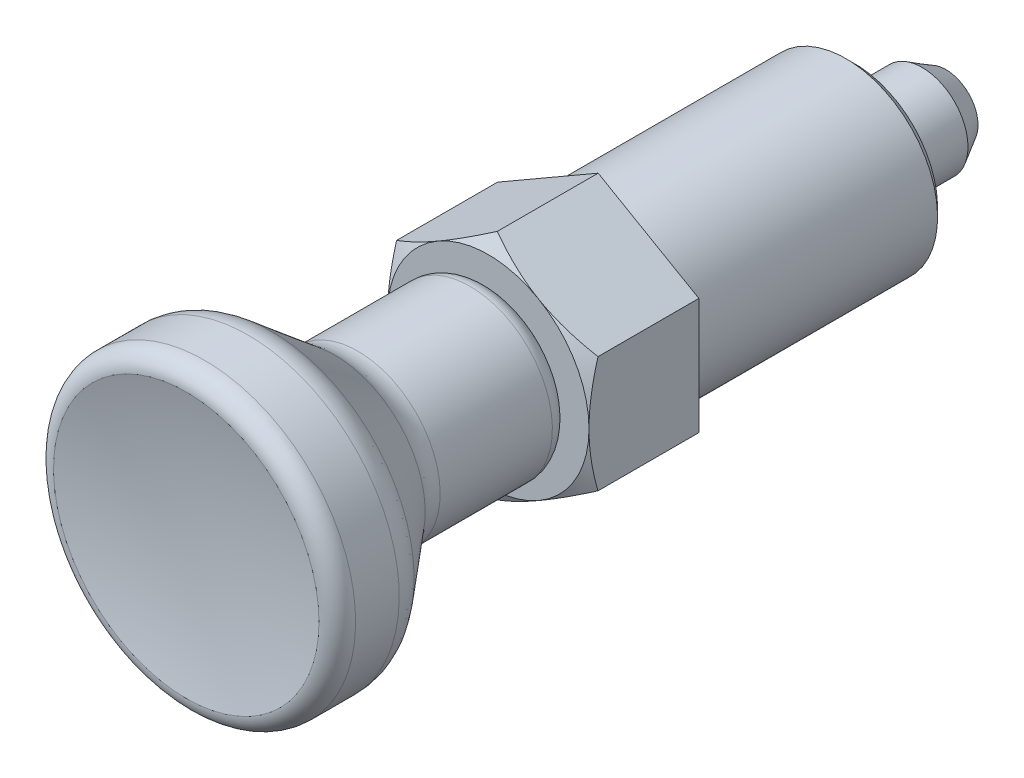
ISO-10303-21;
HEADER;
FILE_DESCRIPTION(('STEP AP214'),'2;1');
FILE_NAME('part.step','',(''),(''),'','','');
FILE_SCHEMA(('AUTOMOTIVE_DESIGN { 1 0 10303 214 1 1 1 1 }'));
ENDSEC;
DATA;
#1=APPLICATION_CONTEXT('core data for automotive mechanical design processes');
#2=APPLICATION_PROTOCOL_DEFINITION('international standard','automotive_design',2000,#1);
#3=PRODUCT_CONTEXT('',#1,'mechanical');
#4=PRODUCT('Part','Part','',(#3));
#5=PRODUCT_RELATED_PRODUCT_CATEGORY('part','',(#4));
#6=PRODUCT_DEFINITION_FORMATION('','',#4);
#7=PRODUCT_DEFINITION_CONTEXT('part definition',#1,'design');
#8=PRODUCT_DEFINITION('design','',#6,#7);
#9=PRODUCT_DEFINITION_SHAPE('','',#8);
#10=(LENGTH_UNIT() NAMED_UNIT(*) SI_UNIT(.MILLI.,.METRE.));
#11=(NAMED_UNIT(*) PLANE_ANGLE_UNIT() SI_UNIT($,.RADIAN.));
#12=(NAMED_UNIT(*) SI_UNIT($,.STERADIAN.) SOLID_ANGLE_UNIT());
#13=UNCERTAINTY_MEASURE_WITH_UNIT(LENGTH_MEASURE(1.E-05),#10,'distance_accuracy_value','');
#14=(GEOMETRIC_REPRESENTATION_CONTEXT(3) GLOBAL_UNCERTAINTY_ASSIGNED_CONTEXT((#13)) GLOBAL_UNIT_ASSIGNED_CONTEXT((#10,
#11,#12)) REPRESENTATION_CONTEXT('',''));
#15=CARTESIAN_POINT('',(0.,0.,0.));
#16=DIRECTION('',(0.,0.,1.));
#17=DIRECTION('',(1.,0.,0.));
#18=AXIS2_PLACEMENT_3D('',#15,#16,#17);
#19=CARTESIAN_POINT('',(0.,0.,10.2679491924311));
#20=DIRECTION('',(0.,0.,-1.));
#21=DIRECTION('',(0.,1.,0.));
#22=AXIS2_PLACEMENT_3D('',#19,#20,#21);
#23=CONICAL_SURFACE('',#22,14.,1.0471975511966);
#24=CARTESIAN_POINT('',(-11.,16.9475873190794,6.68579522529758));
#25=CARTESIAN_POINT('',(-11.,16.7078395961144,6.80189876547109));
#26=CARTESIAN_POINT('',(-11.,16.4678075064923,6.9174148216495));
#27=CARTESIAN_POINT('',(-11.,15.9871152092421,7.14713868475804));
#28=CARTESIAN_POINT('',(-11.,15.7464549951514,7.26134647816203));
#29=CARTESIAN_POINT('',(-11.,15.0233774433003,7.60183836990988));
#30=CARTESIAN_POINT('',(-11.,14.5399358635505,7.82595569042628));
#31=CARTESIAN_POINT('',(-11.,13.5670950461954,8.2682662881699));
#32=CARTESIAN_POINT('',(-11.,13.0776776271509,8.48641967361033));
#33=CARTESIAN_POINT('',(-11.,12.0949113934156,8.91365213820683));
#34=CARTESIAN_POINT('',(-11.,11.601562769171,9.12273165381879));
#35=CARTESIAN_POINT('',(-11.,10.5946510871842,9.53576885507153));
#36=CARTESIAN_POINT('',(-11.,10.0809379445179,9.73936259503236));
#37=CARTESIAN_POINT('',(-11.,9.04745673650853,10.130870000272));
#38=CARTESIAN_POINT('',(-11.,8.52768799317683,10.3187818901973));
#39=CARTESIAN_POINT('',(-11.,7.48229548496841,10.6739078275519));
#40=CARTESIAN_POINT('',(-11.,6.95668640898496,10.8411647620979));
#41=CARTESIAN_POINT('',(-11.,5.89787966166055,11.1495490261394));
#42=CARTESIAN_POINT('',(-11.,5.36468447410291,11.2906847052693));
#43=CARTESIAN_POINT('',(-11.,4.56058944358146,11.4772509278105));
#44=CARTESIAN_POINT('',(-11.,4.29255941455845,11.5351292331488));
#45=CARTESIAN_POINT('',(-11.,3.75468924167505,11.6418066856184));
#46=CARTESIAN_POINT('',(-11.,3.48484913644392,11.6906060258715));
#47=CARTESIAN_POINT('',(-11.,2.94355241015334,11.7782575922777));
#48=CARTESIAN_POINT('',(-11.,2.6720958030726,11.8171099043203));
#49=CARTESIAN_POINT('',(-11.,2.12786354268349,11.8840882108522));
#50=CARTESIAN_POINT('',(-11.,1.85508793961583,11.9122146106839));
#51=CARTESIAN_POINT('',(-11.,1.31211051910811,11.9568359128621));
#52=CARTESIAN_POINT('',(-11.,1.04192067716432,11.9734756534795));
#53=CARTESIAN_POINT('',(-11.,0.501080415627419,11.9953220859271));
#54=CARTESIAN_POINT('',(-11.,0.230430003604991,12.0005289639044));
#55=CARTESIAN_POINT('',(-11.,-0.310849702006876,11.9993861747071));
#56=CARTESIAN_POINT('',(-11.,-0.581478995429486,11.9930364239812));
#57=CARTESIAN_POINT('',(-11.,-1.12223262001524,11.9689333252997));
#58=CARTESIAN_POINT('',(-11.,-1.39235692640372,11.9511794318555));
#59=CARTESIAN_POINT('',(-11.,-2.04498166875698,11.8948814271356));
#60=CARTESIAN_POINT('',(-11.,-2.42700715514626,11.8507360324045));
#61=CARTESIAN_POINT('',(-11.,-3.18815089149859,11.7420670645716));
#62=CARTESIAN_POINT('',(-11.,-3.56726872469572,11.6775406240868));
#63=CARTESIAN_POINT('',(-11.,-4.32226099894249,11.5304052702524));
#64=CARTESIAN_POINT('',(-11.,-4.69813259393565,11.4477818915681));
#65=CARTESIAN_POINT('',(-11.,-5.44607034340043,11.2669675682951));
#66=CARTESIAN_POINT('',(-11.,-5.81813656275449,11.1687768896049));
#67=CARTESIAN_POINT('',(-11.,-6.56654933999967,10.9569168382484));
#68=CARTESIAN_POINT('',(-11.,-6.94281324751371,10.8429575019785));
#69=CARTESIAN_POINT('',(-11.,-7.69163354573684,10.6035085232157));
#70=CARTESIAN_POINT('',(-11.,-8.0641899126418,10.4780188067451));
#71=CARTESIAN_POINT('',(-11.,-8.80578324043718,10.2174800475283));
#72=CARTESIAN_POINT('',(-11.,-9.17482138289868,10.0824343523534));
#73=CARTESIAN_POINT('',(-11.,-9.90985646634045,9.80434835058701));
#74=CARTESIAN_POINT('',(-11.,-10.2758534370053,9.6613081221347));
#75=CARTESIAN_POINT('',(-11.,-11.1142135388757,9.3247854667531));
#76=CARTESIAN_POINT('',(-11.,-11.5856547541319,9.12901029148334));
#77=CARTESIAN_POINT('',(-11.,-12.5247285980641,8.7285047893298));
#78=CARTESIAN_POINT('',(-11.,-12.9923610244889,8.52377399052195));
#79=CARTESIAN_POINT('',(-11.,-13.9244936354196,8.10708188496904));
#80=CARTESIAN_POINT('',(-11.,-14.3889931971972,7.89511918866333));
#81=CARTESIAN_POINT('',(-11.,-15.3152712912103,7.46536426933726));
#82=CARTESIAN_POINT('',(-11.,-15.7770498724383,7.24757215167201));
#83=CARTESIAN_POINT('',(-11.,-16.6987730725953,6.80699211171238));
#84=CARTESIAN_POINT('',(-11.,-17.1587154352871,6.58419947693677));
#85=CARTESIAN_POINT('',(-11.,-18.0766600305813,6.13465365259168));
#86=CARTESIAN_POINT('',(-11.,-18.5346622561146,5.90790044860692));
#87=CARTESIAN_POINT('',(-11.,-19.4489632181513,5.45111550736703));
#88=CARTESIAN_POINT('',(-11.,-19.9052621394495,5.22108413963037));
#89=CARTESIAN_POINT('',(-11.,-20.8164463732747,4.75823700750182));
#90=CARTESIAN_POINT('',(-11.,-21.2713316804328,4.52542123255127));
#91=CARTESIAN_POINT('',(-11.,-22.562113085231,3.86056086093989));
#92=CARTESIAN_POINT('',(-11.,-23.3965608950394,3.42570443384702));
#93=CARTESIAN_POINT('',(-11.,-25.0623255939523,2.54998818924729));
#94=CARTESIAN_POINT('',(-11.,-25.893642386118,2.10912818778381));
#95=CARTESIAN_POINT('',(-11.,-27.5519148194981,1.22379199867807));
#96=CARTESIAN_POINT('',(-11.,-28.3788760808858,0.77932633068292));
#97=CARTESIAN_POINT('',(-11.,-29.6178277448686,0.109922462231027));
#98=CARTESIAN_POINT('',(-11.,-30.0305531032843,-0.113657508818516));
#99=CARTESIAN_POINT('',(-11.,-30.8555616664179,-0.561630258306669));
#100=CARTESIAN_POINT('',(-11.,-31.2678448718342,-0.786023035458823));
#101=CARTESIAN_POINT('',(-11.,-31.6799315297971,-1.0107762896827));
#102=B_SPLINE_CURVE_WITH_KNOTS('',3,(#24,#25,#26,#27,#28,#29,#30,#31,#32,#33,#34,#35,#36,#37,
#38,#39,#40,#41,#42,#43,#44,#45,#46,#47,#48,#49,#50,#51,#52,#53,#54,#55,#56,#57,#58,#59,#60,#61,
#62,#63,#64,#65,#66,#67,#68,#69,#70,#71,#72,#73,#74,#75,#76,#77,#78,#79,#80,#81,#82,#83,#84,#85,
#86,#87,#88,#89,#90,#91,#92,#93,#94,#95,#96,#97,#98,#99,#100,#101),.UNSPECIFIED.,.F.,.F.,(4,2,2,
2,2,2,2,2,2,2,2,2,2,2,2,2,2,2,2,2,2,2,2,2,2,2,2,2,2,2,2,2,2,2,2,2,2,2,4),(0.,0.799142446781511,
1.5982931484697,3.19683688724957,4.80427343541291,6.41163257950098,8.0691960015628,
9.72694682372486,11.3811955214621,13.0349145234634,13.8574094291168,14.6798868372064,
15.5023571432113,16.3247963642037,17.1366658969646,17.9485222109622,18.7603843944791,
19.5722854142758,20.7253478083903,21.8785724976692,23.0327223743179,24.1868525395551,
25.3660595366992,26.5452741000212,27.7240775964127,28.902869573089,30.434171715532,
31.9655546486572,33.4972335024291,35.0288846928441,36.5620455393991,38.0952119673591,
39.6282069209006,41.1612076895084,43.9840470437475,46.8069730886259,49.6234714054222,
51.0316511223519,52.439828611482),.UNSPECIFIED.);
#103=CARTESIAN_POINT('',(-11.,-6.3508529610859,11.0175196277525));
#104=VERTEX_POINT('',#103);
#105=CARTESIAN_POINT('',(-11.,0.,12.));
#106=VERTEX_POINT('',#105);
#107=EDGE_CURVE('E9',#104,#106,#102,.F.);
#108=ORIENTED_EDGE('',*,*,#107,.F.);
#109=CARTESIAN_POINT('',(0.000200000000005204,-12.7018213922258,11.0174529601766));
#110=CARTESIAN_POINT('',(-0.241603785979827,-12.5622159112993,11.0980408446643));
#111=CARTESIAN_POINT('',(-0.484309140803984,-12.4220899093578,11.1749710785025));
#112=CARTESIAN_POINT('',(-0.971666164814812,-12.1407142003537,11.3205013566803));
#113=CARTESIAN_POINT('',(-1.21631844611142,-11.9994641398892,11.3890986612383));
#114=CARTESIAN_POINT('',(-1.95421736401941,-11.5734380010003,11.5810636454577));
#115=CARTESIAN_POINT('',(-2.45037695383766,-11.2869801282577,11.6902522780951));
#116=CARTESIAN_POINT('',(-3.19285703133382,-10.8583090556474,11.8182858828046));
#117=CARTESIAN_POINT('',(-3.43695934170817,-10.7173765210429,11.8547577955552));
#118=CARTESIAN_POINT('',(-3.9262941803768,-10.4348589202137,11.9159186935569));
#119=CARTESIAN_POINT('',(-4.17152673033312,-10.2932738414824,11.9406074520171));
#120=CARTESIAN_POINT('',(-4.66240068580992,-10.0098676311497,11.9775696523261));
#121=CARTESIAN_POINT('',(-4.90804125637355,-9.86804698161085,11.9898578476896));
#122=CARTESIAN_POINT('',(-5.3995500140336,-9.58427426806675,12.0017570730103));
#123=CARTESIAN_POINT('',(-5.64541819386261,-9.4423222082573,12.0013684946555));
#124=CARTESIAN_POINT('',(-6.10507018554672,-9.17694200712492,11.9887988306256));
#125=CARTESIAN_POINT('',(-6.31888677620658,-9.05349494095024,11.9781509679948));
#126=CARTESIAN_POINT('',(-6.7460281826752,-8.80688473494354,11.9474683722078));
#127=CARTESIAN_POINT('',(-6.95935296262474,-8.68372161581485,11.9274329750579));
#128=CARTESIAN_POINT('',(-7.38539481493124,-8.43774623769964,11.8783246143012));
#129=CARTESIAN_POINT('',(-7.59811123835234,-8.31493435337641,11.8492441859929));
#130=CARTESIAN_POINT('',(-8.02254681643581,-8.06988635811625,11.7825560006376));
#131=CARTESIAN_POINT('',(-8.23426590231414,-7.94765028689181,11.7449476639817));
#132=CARTESIAN_POINT('',(-8.87695113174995,-7.57659579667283,11.6183800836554));
#133=CARTESIAN_POINT('',(-9.30605612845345,-7.32885191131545,11.5168005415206));
#134=CARTESIAN_POINT('',(-10.1578675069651,-6.83705838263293,11.286256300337));
#135=CARTESIAN_POINT('',(-10.580584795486,-6.59300244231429,11.1573457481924));
#136=CARTESIAN_POINT('',(-11.0002,-6.35073749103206,11.0174529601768));
#137=B_SPLINE_CURVE_WITH_KNOTS('',3,(#109,#110,#111,#112,#113,#114,#115,#116,#117,#118,#119,
#120,#121,#122,#123,#124,#125,#126,#127,#128,#129,#130,#131,#132,#133,#134,#135,#136),
.UNSPECIFIED.,.F.,.F.,(4,2,2,2,2,2,2,2,2,2,2,2,2,4),(0.,0.871755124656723,1.74379610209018,
3.49159027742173,4.34403665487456,5.19649943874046,6.04794680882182,6.89936787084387,
7.64056020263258,8.38180496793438,9.12366309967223,9.86557166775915,11.3820155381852,
12.8954827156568),.UNSPECIFIED.);
#138=CARTESIAN_POINT('',(-5.50000000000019,-9.52627944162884,12.));
#139=VERTEX_POINT('',#138);
#140=EDGE_CURVE('E204',#139,#104,#137,.T.);
#141=ORIENTED_EDGE('',*,*,#140,.F.);
#142=CARTESIAN_POINT('',(0.,0.,12.));
#143=DIRECTION('',(0.,0.,1.));
#144=DIRECTION('',(0.,-1.,0.));
#145=AXIS2_PLACEMENT_3D('',#142,#143,#144);
#146=CIRCLE('',#145,11.);
#147=EDGE_CURVE('E262',#106,#139,#146,.T.);
#148=ORIENTED_EDGE('',*,*,#147,.F.);
#149=EDGE_LOOP('',(#108,#141,#148));
#150=FACE_BOUND('',#149,.T.);
#151=ADVANCED_FACE('F14',(#150),#23,.T.);
#152=CARTESIAN_POINT('',(-11.,6.3508529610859,11.0175196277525));
#153=VERTEX_POINT('',#152);
#154=EDGE_CURVE('E18',#106,#153,#102,.F.);
#155=ORIENTED_EDGE('',*,*,#154,.F.);
#156=CARTESIAN_POINT('',(-5.50000000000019,9.52627944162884,12.));
#157=VERTEX_POINT('',#156);
#158=EDGE_CURVE('E116',#157,#106,#146,.T.);
#159=ORIENTED_EDGE('',*,*,#158,.F.);
#160=CARTESIAN_POINT('',(-11.0002,6.35073749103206,11.0174529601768));
#161=CARTESIAN_POINT('',(-10.7583962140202,6.49034297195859,11.0980408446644));
#162=CARTESIAN_POINT('',(-10.515690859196,6.63046897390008,11.1749710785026));
#163=CARTESIAN_POINT('',(-10.0283338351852,6.91184468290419,11.3205013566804));
#164=CARTESIAN_POINT('',(-9.78368155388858,7.05309474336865,11.3890986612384));
#165=CARTESIAN_POINT('',(-9.04578263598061,7.47912088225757,11.5810636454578));
#166=CARTESIAN_POINT('',(-8.54962304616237,7.76557875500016,11.6902522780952));
#167=CARTESIAN_POINT('',(-7.80714296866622,8.19424982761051,11.8182858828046));
#168=CARTESIAN_POINT('',(-7.56304065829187,8.33518236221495,11.8547577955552));
#169=CARTESIAN_POINT('',(-7.07370581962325,8.61769996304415,11.9159186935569));
#170=CARTESIAN_POINT('',(-6.82847326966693,8.7592850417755,11.9406074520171));
#171=CARTESIAN_POINT('',(-6.33759931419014,9.04269125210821,11.9775696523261));
#172=CARTESIAN_POINT('',(-6.09195874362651,9.18451190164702,11.9898578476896));
#173=CARTESIAN_POINT('',(-5.60044998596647,9.46828461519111,12.0017570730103));
#174=CARTESIAN_POINT('',(-5.35458180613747,9.61023667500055,12.0013684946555));
#175=CARTESIAN_POINT('',(-4.89492981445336,9.87561687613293,11.9887988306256));
#176=CARTESIAN_POINT('',(-4.6811132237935,9.99906394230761,11.9781509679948));
#177=CARTESIAN_POINT('',(-4.25397181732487,10.2456741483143,11.9474683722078));
#178=CARTESIAN_POINT('',(-4.04064703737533,10.368837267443,11.9274329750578));
#179=CARTESIAN_POINT('',(-3.61460518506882,10.6148126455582,11.8783246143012));
#180=CARTESIAN_POINT('',(-3.40188876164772,10.7376245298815,11.8492441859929));
#181=CARTESIAN_POINT('',(-2.97745318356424,10.9826725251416,11.7825560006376));
#182=CARTESIAN_POINT('',(-2.76573409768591,11.1049085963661,11.7449476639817));
#183=CARTESIAN_POINT('',(-2.12304886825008,11.475963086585,11.6183800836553));
#184=CARTESIAN_POINT('',(-1.69394387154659,11.7237069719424,11.5168005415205));
#185=CARTESIAN_POINT('',(-0.842132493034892,12.215500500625,11.2862563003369));
#186=CARTESIAN_POINT('',(-0.41941520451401,12.4595564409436,11.1573457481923));
#187=CARTESIAN_POINT('',(0.000199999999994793,12.7018213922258,11.0174529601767));
#188=B_SPLINE_CURVE_WITH_KNOTS('',3,(#160,#161,#162,#163,#164,#165,#166,#167,#168,#169,#170,
#171,#172,#173,#174,#175,#176,#177,#178,#179,#180,#181,#182,#183,#184,#185,#186,#187),
.UNSPECIFIED.,.F.,.F.,(4,2,2,2,2,2,2,2,2,2,2,2,2,4),(0.,0.871755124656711,1.74379610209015,
3.49159027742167,4.34403665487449,5.19649943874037,6.04794680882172,6.89936787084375,
7.64056020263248,8.38180496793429,9.12366309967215,9.86557166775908,11.3820155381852,
12.8954827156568),.UNSPECIFIED.);
#189=EDGE_CURVE('E265',#153,#157,#188,.T.);
#190=ORIENTED_EDGE('',*,*,#189,.F.);
#191=EDGE_LOOP('',(#155,#159,#190));
#192=FACE_BOUND('',#191,.T.);
#193=ADVANCED_FACE('F226',(#192),#23,.T.);
#194=CARTESIAN_POINT('',(0.,12.701705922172,11.0175196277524));
#195=VERTEX_POINT('',#194);
#196=EDGE_CURVE('E112',#157,#195,#188,.T.);
#197=ORIENTED_EDGE('',*,*,#196,.F.);
#198=CARTESIAN_POINT('',(5.50000000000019,9.52627944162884,12.));
#199=VERTEX_POINT('',#198);
#200=EDGE_CURVE('E110',#199,#157,#146,.T.);
#201=ORIENTED_EDGE('',*,*,#200,.F.);
#202=CARTESIAN_POINT('',(-0.000200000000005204,12.7018213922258,11.0174529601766));
#203=CARTESIAN_POINT('',(0.241603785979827,12.5622159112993,11.0980408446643));
#204=CARTESIAN_POINT('',(0.484309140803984,12.4220899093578,11.1749710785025));
#205=CARTESIAN_POINT('',(0.971666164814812,12.1407142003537,11.3205013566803));
#206=CARTESIAN_POINT('',(1.21631844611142,11.9994641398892,11.3890986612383));
#207=CARTESIAN_POINT('',(1.95421736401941,11.5734380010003,11.5810636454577));
#208=CARTESIAN_POINT('',(2.45037695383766,11.2869801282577,11.6902522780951));
#209=CARTESIAN_POINT('',(3.19285703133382,10.8583090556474,11.8182858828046));
#210=CARTESIAN_POINT('',(3.43695934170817,10.7173765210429,11.8547577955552));
#211=CARTESIAN_POINT('',(3.9262941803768,10.4348589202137,11.9159186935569));
#212=CARTESIAN_POINT('',(4.17152673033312,10.2932738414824,11.9406074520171));
#213=CARTESIAN_POINT('',(4.66240068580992,10.0098676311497,11.9775696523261));
#214=CARTESIAN_POINT('',(4.90804125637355,9.86804698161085,11.9898578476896));
#215=CARTESIAN_POINT('',(5.3995500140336,9.58427426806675,12.0017570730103));
#216=CARTESIAN_POINT('',(5.64541819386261,9.4423222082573,12.0013684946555));
#217=CARTESIAN_POINT('',(6.10507018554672,9.17694200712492,11.9887988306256));
#218=CARTESIAN_POINT('',(6.31888677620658,9.05349494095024,11.9781509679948));
#219=CARTESIAN_POINT('',(6.7460281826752,8.80688473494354,11.9474683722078));
#220=CARTESIAN_POINT('',(6.95935296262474,8.68372161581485,11.9274329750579));
#221=CARTESIAN_POINT('',(7.38539481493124,8.43774623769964,11.8783246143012));
#222=CARTESIAN_POINT('',(7.59811123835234,8.31493435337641,11.8492441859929));
#223=CARTESIAN_POINT('',(8.02254681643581,8.06988635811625,11.7825560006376));
#224=CARTESIAN_POINT('',(8.23426590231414,7.94765028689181,11.7449476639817));
#225=CARTESIAN_POINT('',(8.87695113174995,7.57659579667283,11.6183800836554));
#226=CARTESIAN_POINT('',(9.30605612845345,7.32885191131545,11.5168005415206));
#227=CARTESIAN_POINT('',(10.1578675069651,6.83705838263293,11.286256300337));
#228=CARTESIAN_POINT('',(10.580584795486,6.59300244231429,11.1573457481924));
#229=CARTESIAN_POINT('',(11.0002,6.35073749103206,11.0174529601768));
#230=B_SPLINE_CURVE_WITH_KNOTS('',3,(#202,#203,#204,#205,#206,#207,#208,#209,#210,#211,#212,
#213,#214,#215,#216,#217,#218,#219,#220,#221,#222,#223,#224,#225,#226,#227,#228,#229),
.UNSPECIFIED.,.F.,.F.,(4,2,2,2,2,2,2,2,2,2,2,2,2,4),(0.,0.871755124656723,1.74379610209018,
3.49159027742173,4.34403665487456,5.19649943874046,6.04794680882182,6.89936787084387,
7.64056020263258,8.38180496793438,9.12366309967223,9.86557166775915,11.3820155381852,
12.8954827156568),.UNSPECIFIED.);
#231=EDGE_CURVE('E90',#195,#199,#230,.T.);
#232=ORIENTED_EDGE('',*,*,#231,.F.);
#233=EDGE_LOOP('',(#197,#201,#232));
#234=FACE_BOUND('',#233,.T.);
#235=ADVANCED_FACE('F111',(#234),#23,.T.);
#236=CARTESIAN_POINT('',(0.,-12.701705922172,11.0175196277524));
#237=VERTEX_POINT('',#236);
#238=EDGE_CURVE('E199',#237,#139,#137,.T.);
#239=ORIENTED_EDGE('',*,*,#238,.F.);
#240=CARTESIAN_POINT('',(11.0002,-6.35073749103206,11.0174529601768));
#241=CARTESIAN_POINT('',(10.7583962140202,-6.49034297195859,11.0980408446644));
#242=CARTESIAN_POINT('',(10.515690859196,-6.63046897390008,11.1749710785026));
#243=CARTESIAN_POINT('',(10.0283338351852,-6.91184468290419,11.3205013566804));
#244=CARTESIAN_POINT('',(9.78368155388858,-7.05309474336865,11.3890986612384));
#245=CARTESIAN_POINT('',(9.04578263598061,-7.47912088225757,11.5810636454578));
#246=CARTESIAN_POINT('',(8.54962304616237,-7.76557875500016,11.6902522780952));
#247=CARTESIAN_POINT('',(7.80714296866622,-8.19424982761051,11.8182858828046));
#248=CARTESIAN_POINT('',(7.56304065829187,-8.33518236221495,11.8547577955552));
#249=CARTESIAN_POINT('',(7.07370581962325,-8.61769996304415,11.9159186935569));
#250=CARTESIAN_POINT('',(6.82847326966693,-8.7592850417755,11.9406074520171));
#251=CARTESIAN_POINT('',(6.33759931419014,-9.04269125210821,11.9775696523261));
#252=CARTESIAN_POINT('',(6.09195874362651,-9.18451190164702,11.9898578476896));
#253=CARTESIAN_POINT('',(5.60044998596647,-9.46828461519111,12.0017570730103));
#254=CARTESIAN_POINT('',(5.35458180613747,-9.61023667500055,12.0013684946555));
#255=CARTESIAN_POINT('',(4.89492981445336,-9.87561687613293,11.9887988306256));
#256=CARTESIAN_POINT('',(4.6811132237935,-9.99906394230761,11.9781509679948));
#257=CARTESIAN_POINT('',(4.25397181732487,-10.2456741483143,11.9474683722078));
#258=CARTESIAN_POINT('',(4.04064703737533,-10.368837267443,11.9274329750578));
#259=CARTESIAN_POINT('',(3.61460518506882,-10.6148126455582,11.8783246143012));
#260=CARTESIAN_POINT('',(3.40188876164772,-10.7376245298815,11.8492441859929));
#261=CARTESIAN_POINT('',(2.97745318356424,-10.9826725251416,11.7825560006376));
#262=CARTESIAN_POINT('',(2.76573409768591,-11.1049085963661,11.7449476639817));
#263=CARTESIAN_POINT('',(2.12304886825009,-11.475963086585,11.6183800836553));
#264=CARTESIAN_POINT('',(1.69394387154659,-11.7237069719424,11.5168005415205));
#265=CARTESIAN_POINT('',(0.842132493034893,-12.215500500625,11.2862563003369));
#266=CARTESIAN_POINT('',(0.419415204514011,-12.4595564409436,11.1573457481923));
#267=CARTESIAN_POINT('',(-0.00019999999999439,-12.7018213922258,11.0174529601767));
#268=B_SPLINE_CURVE_WITH_KNOTS('',3,(#240,#241,#242,#243,#244,#245,#246,#247,#248,#249,#250,
#251,#252,#253,#254,#255,#256,#257,#258,#259,#260,#261,#262,#263,#264,#265,#266,#267),
.UNSPECIFIED.,.F.,.F.,(4,2,2,2,2,2,2,2,2,2,2,2,2,4),(0.,0.871755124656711,1.74379610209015,
3.49159027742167,4.34403665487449,5.19649943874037,6.04794680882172,6.89936787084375,
7.64056020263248,8.38180496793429,9.12366309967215,9.86557166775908,11.3820155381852,
12.8954827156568),.UNSPECIFIED.);
#269=CARTESIAN_POINT('',(5.50000000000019,-9.52627944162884,12.));
#270=VERTEX_POINT('',#269);
#271=EDGE_CURVE('E100',#270,#237,#268,.T.);
#272=ORIENTED_EDGE('',*,*,#271,.F.);
#273=EDGE_CURVE('E123',#139,#270,#146,.T.);
#274=ORIENTED_EDGE('',*,*,#273,.F.);
#275=EDGE_LOOP('',(#239,#272,#274));
#276=FACE_BOUND('',#275,.T.);
#277=ADVANCED_FACE('F244',(#276),#23,.T.);
#278=CARTESIAN_POINT('',(11.,6.3508529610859,11.0175196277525));
#279=VERTEX_POINT('',#278);
#280=EDGE_CURVE('E94',#199,#279,#230,.T.);
#281=ORIENTED_EDGE('',*,*,#280,.F.);
#282=CARTESIAN_POINT('',(11.,0.,12.));
#283=VERTEX_POINT('',#282);
#284=EDGE_CURVE('E106',#283,#199,#146,.T.);
#285=ORIENTED_EDGE('',*,*,#284,.F.);
#286=CARTESIAN_POINT('',(11.,16.9475873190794,6.68579522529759));
#287=CARTESIAN_POINT('',(11.,16.7078395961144,6.8018987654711));
#288=CARTESIAN_POINT('',(11.,16.4678075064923,6.9174148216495));
#289=CARTESIAN_POINT('',(11.,15.9871152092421,7.14713868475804));
#290=CARTESIAN_POINT('',(11.,15.7464549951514,7.26134647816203));
#291=CARTESIAN_POINT('',(11.,15.0233774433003,7.60183836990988));
#292=CARTESIAN_POINT('',(11.,14.5399358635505,7.82595569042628));
#293=CARTESIAN_POINT('',(11.,13.5670950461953,8.26826628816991));
#294=CARTESIAN_POINT('',(11.,13.0776776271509,8.48641967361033));
#295=CARTESIAN_POINT('',(11.,12.0949113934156,8.91365213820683));
#296=CARTESIAN_POINT('',(11.,11.601562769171,9.12273165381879));
#297=CARTESIAN_POINT('',(11.,10.5946510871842,9.53576885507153));
#298=CARTESIAN_POINT('',(11.,10.0809379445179,9.73936259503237));
#299=CARTESIAN_POINT('',(11.,9.04745673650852,10.1308700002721));
#300=CARTESIAN_POINT('',(11.,8.52768799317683,10.3187818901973));
#301=CARTESIAN_POINT('',(11.,7.48229548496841,10.6739078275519));
#302=CARTESIAN_POINT('',(11.,6.95668640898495,10.8411647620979));
#303=CARTESIAN_POINT('',(11.,5.89787966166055,11.1495490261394));
#304=CARTESIAN_POINT('',(11.,5.36468447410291,11.2906847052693));
#305=CARTESIAN_POINT('',(11.,4.56058944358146,11.4772509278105));
#306=CARTESIAN_POINT('',(11.,4.29255941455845,11.5351292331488));
#307=CARTESIAN_POINT('',(11.,3.75468924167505,11.6418066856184));
#308=CARTESIAN_POINT('',(11.,3.48484913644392,11.6906060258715));
#309=CARTESIAN_POINT('',(11.,2.94355241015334,11.7782575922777));
#310=CARTESIAN_POINT('',(11.,2.6720958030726,11.8171099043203));
#311=CARTESIAN_POINT('',(11.,2.12786354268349,11.8840882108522));
#312=CARTESIAN_POINT('',(11.,1.85508793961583,11.9122146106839));
#313=CARTESIAN_POINT('',(11.,1.31211051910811,11.9568359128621));
#314=CARTESIAN_POINT('',(11.,1.04192067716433,11.9734756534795));
#315=CARTESIAN_POINT('',(11.,0.50108041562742,11.9953220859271));
#316=CARTESIAN_POINT('',(11.,0.230430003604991,12.0005289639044));
#317=CARTESIAN_POINT('',(11.,-0.310849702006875,11.9993861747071));
#318=CARTESIAN_POINT('',(11.,-0.581478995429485,11.9930364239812));
#319=CARTESIAN_POINT('',(11.,-1.12223262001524,11.9689333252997));
#320=CARTESIAN_POINT('',(11.,-1.39235692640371,11.9511794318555));
#321=CARTESIAN_POINT('',(11.,-2.04498166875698,11.8948814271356));
#322=CARTESIAN_POINT('',(11.,-2.42700715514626,11.8507360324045));
#323=CARTESIAN_POINT('',(11.,-3.18815089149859,11.7420670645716));
#324=CARTESIAN_POINT('',(11.,-3.56726872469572,11.6775406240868));
#325=CARTESIAN_POINT('',(11.,-4.32226099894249,11.5304052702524));
#326=CARTESIAN_POINT('',(11.,-4.69813259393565,11.4477818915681));
#327=CARTESIAN_POINT('',(11.,-5.44607034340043,11.2669675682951));
#328=CARTESIAN_POINT('',(11.,-5.81813656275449,11.1687768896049));
#329=CARTESIAN_POINT('',(11.,-6.56654933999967,10.9569168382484));
#330=CARTESIAN_POINT('',(11.,-6.94281324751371,10.8429575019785));
#331=CARTESIAN_POINT('',(11.,-7.69163354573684,10.6035085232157));
#332=CARTESIAN_POINT('',(11.,-8.0641899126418,10.4780188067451));
#333=CARTESIAN_POINT('',(11.,-8.80578324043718,10.2174800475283));
#334=CARTESIAN_POINT('',(11.,-9.17482138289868,10.0824343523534));
#335=CARTESIAN_POINT('',(11.,-9.90985646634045,9.80434835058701));
#336=CARTESIAN_POINT('',(11.,-10.2758534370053,9.6613081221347));
#337=CARTESIAN_POINT('',(11.,-11.1142135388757,9.3247854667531));
#338=CARTESIAN_POINT('',(11.,-11.5856547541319,9.12901029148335));
#339=CARTESIAN_POINT('',(11.,-12.5247285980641,8.7285047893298));
#340=CARTESIAN_POINT('',(11.,-12.9923610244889,8.52377399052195));
#341=CARTESIAN_POINT('',(11.,-13.9244936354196,8.10708188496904));
#342=CARTESIAN_POINT('',(11.,-14.3889931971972,7.89511918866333));
#343=CARTESIAN_POINT('',(11.,-15.3152712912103,7.46536426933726));
#344=CARTESIAN_POINT('',(11.,-15.7770498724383,7.24757215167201));
#345=CARTESIAN_POINT('',(11.,-16.6987730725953,6.80699211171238));
#346=CARTESIAN_POINT('',(11.,-17.1587154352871,6.58419947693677));
#347=CARTESIAN_POINT('',(11.,-18.0766600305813,6.13465365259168));
#348=CARTESIAN_POINT('',(11.,-18.5346622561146,5.90790044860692));
#349=CARTESIAN_POINT('',(11.,-19.4489632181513,5.45111550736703));
#350=CARTESIAN_POINT('',(11.,-19.9052621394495,5.22108413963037));
#351=CARTESIAN_POINT('',(11.,-20.8164463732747,4.75823700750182));
#352=CARTESIAN_POINT('',(11.,-21.2713316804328,4.52542123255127));
#353=CARTESIAN_POINT('',(11.,-22.562113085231,3.86056086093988));
#354=CARTESIAN_POINT('',(11.,-23.3965608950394,3.42570443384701));
#355=CARTESIAN_POINT('',(11.,-25.0623255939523,2.54998818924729));
#356=CARTESIAN_POINT('',(11.,-25.893642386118,2.10912818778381));
#357=CARTESIAN_POINT('',(11.,-27.5519148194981,1.22379199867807));
#358=CARTESIAN_POINT('',(11.,-28.3788760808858,0.779326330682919));
#359=CARTESIAN_POINT('',(11.,-29.6178277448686,0.109922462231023));
#360=CARTESIAN_POINT('',(11.,-30.0305531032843,-0.113657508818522));
#361=CARTESIAN_POINT('',(11.,-30.8555616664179,-0.561630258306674));
#362=CARTESIAN_POINT('',(11.,-31.2678448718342,-0.786023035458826));
#363=CARTESIAN_POINT('',(11.,-31.6799315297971,-1.0107762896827));
#364=B_SPLINE_CURVE_WITH_KNOTS('',3,(#286,#287,#288,#289,#290,#291,#292,#293,#294,#295,#296,
#297,#298,#299,#300,#301,#302,#303,#304,#305,#306,#307,#308,#309,#310,#311,#312,#313,#314,#315,
#316,#317,#318,#319,#320,#321,#322,#323,#324,#325,#326,#327,#328,#329,#330,#331,#332,#333,#334,
#335,#336,#337,#338,#339,#340,#341,#342,#343,#344,#345,#346,#347,#348,#349,#350,#351,#352,#353,
#354,#355,#356,#357,#358,#359,#360,#361,#362,#363),.UNSPECIFIED.,.F.,.F.,(4,2,2,2,2,2,2,2,2,2,2,
2,2,2,2,2,2,2,2,2,2,2,2,2,2,2,2,2,2,2,2,2,2,2,2,2,2,2,4),(0.,0.799142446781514,1.5982931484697,
3.19683688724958,4.80427343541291,6.41163257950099,8.06919600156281,9.72694682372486,
11.3811955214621,13.0349145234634,13.8574094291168,14.6798868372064,15.5023571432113,
16.3247963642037,17.1366658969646,17.9485222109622,18.7603843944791,19.5722854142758,
20.7253478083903,21.8785724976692,23.0327223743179,24.1868525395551,25.3660595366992,
26.5452741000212,27.7240775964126,28.902869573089,30.434171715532,31.9655546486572,
33.4972335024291,35.0288846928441,36.5620455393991,38.0952119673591,39.6282069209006,
41.1612076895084,43.9840470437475,46.8069730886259,49.6234714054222,51.0316511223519,
52.439828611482),.UNSPECIFIED.);
#365=EDGE_CURVE('E41',#279,#283,#364,.T.);
#366=ORIENTED_EDGE('',*,*,#365,.F.);
#367=EDGE_LOOP('',(#281,#285,#366));
#368=FACE_BOUND('',#367,.T.);
#369=ADVANCED_FACE('F104',(#368),#23,.T.);
#370=CARTESIAN_POINT('',(11.,-6.3508529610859,11.0175196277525));
#371=VERTEX_POINT('',#370);
#372=EDGE_CURVE('E108',#371,#270,#268,.T.);
#373=ORIENTED_EDGE('',*,*,#372,.F.);
#374=EDGE_CURVE('E169',#283,#371,#364,.T.);
#375=ORIENTED_EDGE('',*,*,#374,.F.);
#376=EDGE_CURVE('E121',#270,#283,#146,.T.);
#377=ORIENTED_EDGE('',*,*,#376,.F.);
#378=EDGE_LOOP('',(#373,#375,#377));
#379=FACE_BOUND('',#378,.T.);
#380=ADVANCED_FACE('F228',(#379),#23,.T.);
#381=CARTESIAN_POINT('',(-1.11213122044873E-11,0.,109.387498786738));
#382=DIRECTION('',(0.,0.,1.));
#383=DIRECTION('',(1.,0.,0.));
#384=AXIS2_PLACEMENT_3D('',#381,#382,#383);
#385=SPHERICAL_SURFACE('',#384,66.0000000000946);
#386=CARTESIAN_POINT('',(0.,0.,45.));
#387=DIRECTION('',(0.,0.,1.));
#388=DIRECTION('',(0.,-1.,0.));
#389=AXIS2_PLACEMENT_3D('',#386,#387,#388);
#390=CIRCLE('',#389,14.500000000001);
#391=CARTESIAN_POINT('',(0.,-14.500000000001,45.));
#392=VERTEX_POINT('',#391);
#393=EDGE_CURVE('E166',#392,#392,#390,.T.);
#394=ORIENTED_EDGE('',*,*,#393,.T.);
#395=EDGE_LOOP('',(#394));
#396=FACE_BOUND('',#395,.T.);
#397=ADVANCED_FACE('F16',(#396),#385,.F.);
#398=CARTESIAN_POINT('',(0.,0.,43.));
#399=DIRECTION('',(0.,0.,1.));
#400=DIRECTION('',(0.,-1.,0.));
#401=AXIS2_PLACEMENT_3D('',#398,#399,#400);
#402=TOROIDAL_SURFACE('',#401,14.4999999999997,2.00000000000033);
#403=CARTESIAN_POINT('',(0.,0.,43.));
#404=DIRECTION('',(0.,0.,1.));
#405=DIRECTION('',(0.,-1.,0.));
#406=AXIS2_PLACEMENT_3D('',#403,#404,#405);
#407=CIRCLE('',#406,16.5);
#408=CARTESIAN_POINT('',(0.,-16.5,43.));
#409=VERTEX_POINT('',#408);
#410=EDGE_CURVE('E163',#409,#409,#407,.T.);
#411=ORIENTED_EDGE('',*,*,#410,.T.);
#412=EDGE_LOOP('',(#411));
#413=FACE_BOUND('',#412,.T.);
#414=ORIENTED_EDGE('',*,*,#393,.F.);
#415=EDGE_LOOP('',(#414));
#416=FACE_BOUND('',#415,.T.);
#417=ADVANCED_FACE('F242',(#413,#416),#402,.T.);
#418=CARTESIAN_POINT('',(0.,0.,-88.));
#419=DIRECTION('',(0.,0.,1.));
#420=DIRECTION('',(0.,-1.,0.));
#421=AXIS2_PLACEMENT_3D('',#418,#419,#420);
#422=CYLINDRICAL_SURFACE('',#421,16.5);
#423=CARTESIAN_POINT('',(0.,0.,38.235930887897));
#424=DIRECTION('',(0.,0.,1.));
#425=DIRECTION('',(0.,-1.,0.));
#426=AXIS2_PLACEMENT_3D('',#423,#424,#425);
#427=CIRCLE('',#426,16.5);
#428=CARTESIAN_POINT('',(0.,-16.5,38.235930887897));
#429=VERTEX_POINT('',#428);
#430=EDGE_CURVE('E160',#429,#429,#427,.T.);
#431=ORIENTED_EDGE('',*,*,#430,.T.);
#432=EDGE_LOOP('',(#431));
#433=FACE_BOUND('',#432,.T.);
#434=ORIENTED_EDGE('',*,*,#410,.F.);
#435=EDGE_LOOP('',(#434));
#436=FACE_BOUND('',#435,.T.);
#437=ADVANCED_FACE('F343',(#433,#436),#422,.T.);
#438=CARTESIAN_POINT('',(0.,0.,38.2359308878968));
#439=DIRECTION('',(0.,0.,1.));
#440=DIRECTION('',(0.,-1.,0.));
#441=AXIS2_PLACEMENT_3D('',#438,#439,#440);
#442=TOROIDAL_SURFACE('',#441,12.499999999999,4.00000000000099);
#443=CARTESIAN_POINT('',(0.,0.,35.691913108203));
#444=DIRECTION('',(0.,0.,1.));
#445=DIRECTION('',(0.,-1.,0.));
#446=AXIS2_PLACEMENT_3D('',#443,#444,#445);
#447=CIRCLE('',#446,15.586741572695);
#448=CARTESIAN_POINT('',(0.,-15.586741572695,35.691913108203));
#449=VERTEX_POINT('',#448);
#450=EDGE_CURVE('E157',#449,#449,#447,.T.);
#451=ORIENTED_EDGE('',*,*,#450,.T.);
#452=EDGE_LOOP('',(#451));
#453=FACE_BOUND('',#452,.T.);
#454=ORIENTED_EDGE('',*,*,#430,.F.);
#455=EDGE_LOOP('',(#454));
#456=FACE_BOUND('',#455,.T.);
#457=ADVANCED_FACE('F339',(#453,#456),#442,.T.);
#458=CARTESIAN_POINT('',(0.,0.,35.691913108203));
#459=DIRECTION('',(0.,0.,1.));
#460=DIRECTION('',(0.,-1.,0.));
#461=AXIS2_PLACEMENT_3D('',#458,#459,#460);
#462=CONICAL_SURFACE('',#461,15.586741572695,0.689309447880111);
#463=CARTESIAN_POINT('',(0.,0.,28.808086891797));
#464=DIRECTION('',(0.,0.,1.));
#465=DIRECTION('',(0.,-1.,0.));
#466=AXIS2_PLACEMENT_3D('',#463,#464,#465);
#467=CIRCLE('',#466,9.9132584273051);
#468=CARTESIAN_POINT('',(0.,-9.9132584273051,28.808086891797));
#469=VERTEX_POINT('',#468);
#470=EDGE_CURVE('E154',#469,#469,#467,.T.);
#471=ORIENTED_EDGE('',*,*,#470,.T.);
#472=EDGE_LOOP('',(#471));
#473=FACE_BOUND('',#472,.T.);
#474=ORIENTED_EDGE('',*,*,#450,.F.);
#475=EDGE_LOOP('',(#474));
#476=FACE_BOUND('',#475,.T.);
#477=ADVANCED_FACE('F335',(#473,#476),#462,.T.);
#478=CARTESIAN_POINT('',(0.,0.,26.2640691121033));
#479=DIRECTION('',(0.,0.,1.));
#480=DIRECTION('',(0.,-1.,0.));
#481=AXIS2_PLACEMENT_3D('',#478,#479,#480);
#482=TOROIDAL_SURFACE('',#481,13.0000000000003,4.00000000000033);
#483=CARTESIAN_POINT('',(0.,0.,26.264069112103));
#484=DIRECTION('',(0.,0.,1.));
#485=DIRECTION('',(0.,-1.,0.));
#486=AXIS2_PLACEMENT_3D('',#483,#484,#485);
#487=CIRCLE('',#486,9.);
#488=CARTESIAN_POINT('',(0.,-9.,26.264069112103));
#489=VERTEX_POINT('',#488);
#490=EDGE_CURVE('E151',#489,#489,#487,.T.);
#491=ORIENTED_EDGE('',*,*,#490,.T.);
#492=EDGE_LOOP('',(#491));
#493=FACE_BOUND('',#492,.T.);
#494=ORIENTED_EDGE('',*,*,#470,.F.);
#495=EDGE_LOOP('',(#494));
#496=FACE_BOUND('',#495,.T.);
#497=ADVANCED_FACE('F331',(#493,#496),#482,.F.);
#498=CARTESIAN_POINT('',(0.,0.,-88.));
#499=DIRECTION('',(0.,0.,1.));
#500=DIRECTION('',(0.,-1.,0.));
#501=AXIS2_PLACEMENT_3D('',#498,#499,#500);
#502=CYLINDRICAL_SURFACE('',#501,9.);
#503=CARTESIAN_POINT('',(0.,0.,14.));
#504=DIRECTION('',(0.,0.,1.));
#505=DIRECTION('',(0.,-1.,0.));
#506=AXIS2_PLACEMENT_3D('',#503,#504,#505);
#507=CIRCLE('',#506,9.);
#508=CARTESIAN_POINT('',(0.,-9.,14.));
#509=VERTEX_POINT('',#508);
#510=EDGE_CURVE('E148',#509,#509,#507,.T.);
#511=ORIENTED_EDGE('',*,*,#510,.T.);
#512=EDGE_LOOP('',(#511));
#513=FACE_BOUND('',#512,.T.);
#514=ORIENTED_EDGE('',*,*,#490,.F.);
#515=EDGE_LOOP('',(#514));
#516=FACE_BOUND('',#515,.T.);
#517=ADVANCED_FACE('F327',(#513,#516),#502,.T.);
#518=CARTESIAN_POINT('',(0.,0.,14.));
#519=DIRECTION('',(0.,0.,1.));
#520=DIRECTION('',(0.,-1.,0.));
#521=AXIS2_PLACEMENT_3D('',#518,#519,#520);
#522=TOROIDAL_SURFACE('',#521,7.,2.);
#523=CARTESIAN_POINT('',(0.,0.,12.));
#524=DIRECTION('',(0.,0.,1.));
#525=DIRECTION('',(0.,-1.,0.));
#526=AXIS2_PLACEMENT_3D('',#523,#524,#525);
#527=CIRCLE('',#526,7.);
#528=CARTESIAN_POINT('',(0.,-7.,12.));
#529=VERTEX_POINT('',#528);
#530=EDGE_CURVE('E145',#529,#529,#527,.T.);
#531=ORIENTED_EDGE('',*,*,#530,.T.);
#532=EDGE_LOOP('',(#531));
#533=FACE_BOUND('',#532,.T.);
#534=ORIENTED_EDGE('',*,*,#510,.F.);
#535=EDGE_LOOP('',(#534));
#536=FACE_BOUND('',#535,.T.);
#537=ADVANCED_FACE('F313',(#533,#536),#522,.T.);
#538=CARTESIAN_POINT('',(11.,0.,12.));
#539=DIRECTION('',(0.,0.,-1.));
#540=DIRECTION('',(0.,1.,0.));
#541=AXIS2_PLACEMENT_3D('',#538,#539,#540);
#542=PLANE('',#541);
#543=ORIENTED_EDGE('',*,*,#530,.F.);
#544=EDGE_LOOP('',(#543));
#545=FACE_BOUND('',#544,.T.);
#546=ORIENTED_EDGE('',*,*,#376,.T.);
#547=ORIENTED_EDGE('',*,*,#284,.T.);
#548=ORIENTED_EDGE('',*,*,#200,.T.);
#549=ORIENTED_EDGE('',*,*,#158,.T.);
#550=ORIENTED_EDGE('',*,*,#147,.T.);
#551=ORIENTED_EDGE('',*,*,#273,.T.);
#552=EDGE_LOOP('',(#546,#547,#548,#549,#550,#551));
#553=FACE_BOUND('',#552,.T.);
#554=ADVANCED_FACE('F118',(#545,#553),#542,.F.);
#555=CARTESIAN_POINT('',(11.,6.3508529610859,-2.));
#556=DIRECTION('',(0.500000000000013,0.866025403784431,0.));
#557=DIRECTION('',(-0.866025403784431,0.500000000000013,0.));
#558=AXIS2_PLACEMENT_3D('',#555,#556,#557);
#559=PLANE('',#558);
#560=DIRECTION('',(-0.866025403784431,0.500000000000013,0.));
#561=VECTOR('',#560,1.);
#562=CARTESIAN_POINT('',(13.,5.19615242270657,0.));
#563=LINE('',#562,#561);
#564=CARTESIAN_POINT('',(11.,6.3508529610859,0.));
#565=VERTEX_POINT('',#564);
#566=CARTESIAN_POINT('',(0.,12.701705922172,0.));
#567=VERTEX_POINT('',#566);
#568=EDGE_CURVE('E126',#565,#567,#563,.T.);
#569=ORIENTED_EDGE('',*,*,#568,.T.);
#570=DIRECTION('',(0.,0.,1.));
#571=VECTOR('',#570,1.);
#572=CARTESIAN_POINT('',(0.,12.701705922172,-2.));
#573=LINE('',#572,#571);
#574=EDGE_CURVE('E96',#567,#195,#573,.T.);
#575=ORIENTED_EDGE('',*,*,#574,.T.);
#576=ORIENTED_EDGE('',*,*,#231,.T.);
#577=ORIENTED_EDGE('',*,*,#280,.T.);
#578=DIRECTION('',(0.,0.,1.));
#579=VECTOR('',#578,1.);
#580=CARTESIAN_POINT('',(11.,6.3508529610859,-2.));
#581=LINE('',#580,#579);
#582=EDGE_CURVE('E286',#565,#279,#581,.T.);
#583=ORIENTED_EDGE('',*,*,#582,.F.);
#584=EDGE_LOOP('',(#569,#575,#576,#577,#583));
#585=FACE_BOUND('',#584,.T.);
#586=ADVANCED_FACE('F92',(#585),#559,.T.);
#587=CARTESIAN_POINT('',(0.,12.701705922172,-2.));
#588=DIRECTION('',(-0.500000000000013,0.866025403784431,0.));
#589=DIRECTION('',(-0.866025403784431,-0.500000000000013,0.));
#590=AXIS2_PLACEMENT_3D('',#587,#588,#589);
#591=PLANE('',#590);
#592=DIRECTION('',(-0.866025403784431,-0.500000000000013,0.));
#593=VECTOR('',#592,1.);
#594=CARTESIAN_POINT('',(1.99999999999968,13.8564064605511,0.));
#595=LINE('',#594,#593);
#596=CARTESIAN_POINT('',(-11.,6.3508529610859,0.));
#597=VERTEX_POINT('',#596);
#598=EDGE_CURVE('E269',#567,#597,#595,.T.);
#599=ORIENTED_EDGE('',*,*,#598,.T.);
#600=DIRECTION('',(0.,0.,1.));
#601=VECTOR('',#600,1.);
#602=CARTESIAN_POINT('',(-11.,6.3508529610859,-2.));
#603=LINE('',#602,#601);
#604=EDGE_CURVE('E272',#597,#153,#603,.T.);
#605=ORIENTED_EDGE('',*,*,#604,.T.);
#606=ORIENTED_EDGE('',*,*,#189,.T.);
#607=ORIENTED_EDGE('',*,*,#196,.T.);
#608=ORIENTED_EDGE('',*,*,#574,.F.);
#609=EDGE_LOOP('',(#599,#605,#606,#607,#608));
#610=FACE_BOUND('',#609,.T.);
#611=ADVANCED_FACE('F193',(#610),#591,.T.);
#612=CARTESIAN_POINT('',(-11.,6.3508529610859,-2.));
#613=DIRECTION('',(-1.,0.,0.));
#614=DIRECTION('',(0.,-1.,0.));
#615=AXIS2_PLACEMENT_3D('',#612,#613,#614);
#616=PLANE('',#615);
#617=DIRECTION('',(0.,-1.,0.));
#618=VECTOR('',#617,1.);
#619=CARTESIAN_POINT('',(-11.,0.,0.));
#620=LINE('',#619,#618);
#621=CARTESIAN_POINT('',(-11.,-6.3508529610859,0.));
#622=VERTEX_POINT('',#621);
#623=EDGE_CURVE('E279',#597,#622,#620,.T.);
#624=ORIENTED_EDGE('',*,*,#623,.T.);
#625=DIRECTION('',(0.,0.,1.));
#626=VECTOR('',#625,1.);
#627=CARTESIAN_POINT('',(-11.,-6.3508529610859,-2.));
#628=LINE('',#627,#626);
#629=EDGE_CURVE('E259',#622,#104,#628,.T.);
#630=ORIENTED_EDGE('',*,*,#629,.T.);
#631=ORIENTED_EDGE('',*,*,#107,.T.);
#632=ORIENTED_EDGE('',*,*,#154,.T.);
#633=ORIENTED_EDGE('',*,*,#604,.F.);
#634=EDGE_LOOP('',(#624,#630,#631,#632,#633));
#635=FACE_BOUND('',#634,.T.);
#636=ADVANCED_FACE('F213',(#635),#616,.T.);
#637=CARTESIAN_POINT('',(-11.,-6.3508529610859,-2.));
#638=DIRECTION('',(-0.500000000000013,-0.866025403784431,0.));
#639=DIRECTION('',(0.866025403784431,-0.500000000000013,0.));
#640=AXIS2_PLACEMENT_3D('',#637,#638,#639);
#641=PLANE('',#640);
#642=DIRECTION('',(0.866025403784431,-0.500000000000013,0.));
#643=VECTOR('',#642,1.);
#644=CARTESIAN_POINT('',(1.99999999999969,-13.8564064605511,0.));
#645=LINE('',#644,#643);
#646=CARTESIAN_POINT('',(0.,-12.701705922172,0.));
#647=VERTEX_POINT('',#646);
#648=EDGE_CURVE('E258',#622,#647,#645,.T.);
#649=ORIENTED_EDGE('',*,*,#648,.T.);
#650=DIRECTION('',(0.,0.,1.));
#651=VECTOR('',#650,1.);
#652=CARTESIAN_POINT('',(0.,-12.701705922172,-2.));
#653=LINE('',#652,#651);
#654=EDGE_CURVE('E250',#647,#237,#653,.T.);
#655=ORIENTED_EDGE('',*,*,#654,.T.);
#656=ORIENTED_EDGE('',*,*,#238,.T.);
#657=ORIENTED_EDGE('',*,*,#140,.T.);
#658=ORIENTED_EDGE('',*,*,#629,.F.);
#659=EDGE_LOOP('',(#649,#655,#656,#657,#658));
#660=FACE_BOUND('',#659,.T.);
#661=ADVANCED_FACE('F210',(#660),#641,.T.);
#662=CARTESIAN_POINT('',(0.,-12.701705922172,-2.));
#663=DIRECTION('',(0.500000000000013,-0.866025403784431,0.));
#664=DIRECTION('',(0.866025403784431,0.500000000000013,0.));
#665=AXIS2_PLACEMENT_3D('',#662,#663,#664);
#666=PLANE('',#665);
#667=DIRECTION('',(0.866025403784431,0.500000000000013,0.));
#668=VECTOR('',#667,1.);
#669=CARTESIAN_POINT('',(13.,-5.19615242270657,0.));
#670=LINE('',#669,#668);
#671=CARTESIAN_POINT('',(11.,-6.3508529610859,0.));
#672=VERTEX_POINT('',#671);
#673=EDGE_CURVE('E283',#647,#672,#670,.T.);
#674=ORIENTED_EDGE('',*,*,#673,.T.);
#675=DIRECTION('',(0.,0.,1.));
#676=VECTOR('',#675,1.);
#677=CARTESIAN_POINT('',(11.,-6.3508529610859,-2.));
#678=LINE('',#677,#676);
#679=EDGE_CURVE('E35',#672,#371,#678,.T.);
#680=ORIENTED_EDGE('',*,*,#679,.T.);
#681=ORIENTED_EDGE('',*,*,#372,.T.);
#682=ORIENTED_EDGE('',*,*,#271,.T.);
#683=ORIENTED_EDGE('',*,*,#654,.F.);
#684=EDGE_LOOP('',(#674,#680,#681,#682,#683));
#685=FACE_BOUND('',#684,.T.);
#686=ADVANCED_FACE('F188',(#685),#666,.T.);
#687=CARTESIAN_POINT('',(11.,-6.3508529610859,-2.));
#688=DIRECTION('',(1.,0.,0.));
#689=DIRECTION('',(0.,1.,0.));
#690=AXIS2_PLACEMENT_3D('',#687,#688,#689);
#691=PLANE('',#690);
#692=DIRECTION('',(0.,1.,0.));
#693=VECTOR('',#692,1.);
#694=CARTESIAN_POINT('',(11.,0.,0.));
#695=LINE('',#694,#693);
#696=EDGE_CURVE('E271',#672,#565,#695,.T.);
#697=ORIENTED_EDGE('',*,*,#696,.T.);
#698=ORIENTED_EDGE('',*,*,#582,.T.);
#699=ORIENTED_EDGE('',*,*,#365,.T.);
#700=ORIENTED_EDGE('',*,*,#374,.T.);
#701=ORIENTED_EDGE('',*,*,#679,.F.);
#702=EDGE_LOOP('',(#697,#698,#699,#700,#701));
#703=FACE_BOUND('',#702,.T.);
#704=ADVANCED_FACE('F184',(#703),#691,.T.);
#705=CARTESIAN_POINT('',(3.498889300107,0.,-38.));
#706=DIRECTION('',(0.,0.,-1.));
#707=DIRECTION('',(0.,1.,0.));
#708=AXIS2_PLACEMENT_3D('',#705,#706,#707);
#709=PLANE('',#708);
#710=CARTESIAN_POINT('',(0.,0.,-38.));
#711=DIRECTION('',(0.,0.,1.));
#712=DIRECTION('',(0.,-1.,0.));
#713=AXIS2_PLACEMENT_3D('',#710,#711,#712);
#714=CIRCLE('',#713,3.498889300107);
#715=CARTESIAN_POINT('',(0.,-3.498889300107,-38.));
#716=VERTEX_POINT('',#715);
#717=EDGE_CURVE('E139',#716,#716,#714,.T.);
#718=ORIENTED_EDGE('',*,*,#717,.F.);
#719=EDGE_LOOP('',(#718));
#720=FACE_BOUND('',#719,.T.);
#721=ADVANCED_FACE('F187',(#720),#709,.T.);
#722=CARTESIAN_POINT('',(0.,0.,-35.4));
#723=DIRECTION('',(0.,0.,1.));
#724=DIRECTION('',(0.,-1.,0.));
#725=AXIS2_PLACEMENT_3D('',#722,#723,#724);
#726=CONICAL_SURFACE('',#725,5.,0.523598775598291);
#727=ORIENTED_EDGE('',*,*,#717,.T.);
#728=EDGE_LOOP('',(#727));
#729=FACE_BOUND('',#728,.T.);
#730=CARTESIAN_POINT('',(0.,0.,-35.4));
#731=DIRECTION('',(0.,0.,1.));
#732=DIRECTION('',(0.,-1.,0.));
#733=AXIS2_PLACEMENT_3D('',#730,#731,#732);
#734=CIRCLE('',#733,5.);
#735=CARTESIAN_POINT('',(0.,-5.,-35.4));
#736=VERTEX_POINT('',#735);
#737=EDGE_CURVE('E142',#736,#736,#734,.T.);
#738=ORIENTED_EDGE('',*,*,#737,.F.);
#739=EDGE_LOOP('',(#738));
#740=FACE_BOUND('',#739,.T.);
#741=ADVANCED_FACE('F317',(#729,#740),#726,.T.);
#742=CARTESIAN_POINT('',(0.,0.,-88.));
#743=DIRECTION('',(0.,0.,1.));
#744=DIRECTION('',(0.,-1.,0.));
#745=AXIS2_PLACEMENT_3D('',#742,#743,#744);
#746=CYLINDRICAL_SURFACE('',#745,5.);
#747=ORIENTED_EDGE('',*,*,#737,.T.);
#748=EDGE_LOOP('',(#747));
#749=FACE_BOUND('',#748,.T.);
#750=CARTESIAN_POINT('',(0.,0.,-28.));
#751=DIRECTION('',(0.,0.,1.));
#752=DIRECTION('',(0.,-1.,0.));
#753=AXIS2_PLACEMENT_3D('',#750,#751,#752);
#754=CIRCLE('',#753,5.);
#755=CARTESIAN_POINT('',(0.,-5.,-28.));
#756=VERTEX_POINT('',#755);
#757=EDGE_CURVE('E136',#756,#756,#754,.T.);
#758=ORIENTED_EDGE('',*,*,#757,.F.);
#759=EDGE_LOOP('',(#758));
#760=FACE_BOUND('',#759,.T.);
#761=ADVANCED_FACE('F309',(#749,#760),#746,.T.);
#762=CARTESIAN_POINT('',(5.,0.,-28.));
#763=DIRECTION('',(0.,0.,1.));
#764=DIRECTION('',(0.,-1.,0.));
#765=AXIS2_PLACEMENT_3D('',#762,#763,#764);
#766=PLANE('',#765);
#767=CARTESIAN_POINT('',(0.,0.,-28.));
#768=DIRECTION('',(0.,0.,1.));
#769=DIRECTION('',(0.,-1.,0.));
#770=AXIS2_PLACEMENT_3D('',#767,#768,#769);
#771=CIRCLE('',#770,9.08);
#772=CARTESIAN_POINT('',(0.,-9.08,-28.));
#773=VERTEX_POINT('',#772);
#774=EDGE_CURVE('E133',#773,#773,#771,.T.);
#775=ORIENTED_EDGE('',*,*,#774,.F.);
#776=EDGE_LOOP('',(#775));
#777=FACE_BOUND('',#776,.T.);
#778=ORIENTED_EDGE('',*,*,#757,.T.);
#779=EDGE_LOOP('',(#778));
#780=FACE_BOUND('',#779,.T.);
#781=ADVANCED_FACE('F305',(#777,#780),#766,.F.);
#782=CARTESIAN_POINT('',(0.,0.,-28.));
#783=DIRECTION('',(0.,0.,1.));
#784=DIRECTION('',(0.,-1.,0.));
#785=AXIS2_PLACEMENT_3D('',#782,#783,#784);
#786=CONICAL_SURFACE('',#785,9.08,0.785398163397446);
#787=CARTESIAN_POINT('',(0.,0.,-27.08));
#788=DIRECTION('',(0.,0.,1.));
#789=DIRECTION('',(0.,-1.,0.));
#790=AXIS2_PLACEMENT_3D('',#787,#788,#789);
#791=CIRCLE('',#790,10.);
#792=CARTESIAN_POINT('',(0.,-10.,-27.08));
#793=VERTEX_POINT('',#792);
#794=EDGE_CURVE('E130',#793,#793,#791,.T.);
#795=ORIENTED_EDGE('',*,*,#794,.F.);
#796=EDGE_LOOP('',(#795));
#797=FACE_BOUND('',#796,.T.);
#798=ORIENTED_EDGE('',*,*,#774,.T.);
#799=EDGE_LOOP('',(#798));
#800=FACE_BOUND('',#799,.T.);
#801=ADVANCED_FACE('F299',(#797,#800),#786,.T.);
#802=CARTESIAN_POINT('',(0.,0.,-28.));
#803=DIRECTION('',(0.,0.,1.));
#804=DIRECTION('',(0.,-1.,0.));
#805=AXIS2_PLACEMENT_3D('',#802,#803,#804);
#806=CYLINDRICAL_SURFACE('',#805,10.);
#807=CARTESIAN_POINT('',(0.,0.,0.));
#808=DIRECTION('',(0.,0.,1.));
#809=DIRECTION('',(0.,-1.,0.));
#810=AXIS2_PLACEMENT_3D('',#807,#808,#809);
#811=CIRCLE('',#810,10.);
#812=CARTESIAN_POINT('',(0.,-10.,0.));
#813=VERTEX_POINT('',#812);
#814=EDGE_CURVE('E122',#813,#813,#811,.T.);
#815=ORIENTED_EDGE('',*,*,#814,.F.);
#816=EDGE_LOOP('',(#815));
#817=FACE_BOUND('',#816,.T.);
#818=ORIENTED_EDGE('',*,*,#794,.T.);
#819=EDGE_LOOP('',(#818));
#820=FACE_BOUND('',#819,.T.);
#821=ADVANCED_FACE('F292',(#817,#820),#806,.T.);
#822=CARTESIAN_POINT('',(10.,0.,0.));
#823=DIRECTION('',(0.,0.,1.));
#824=DIRECTION('',(0.,-1.,0.));
#825=AXIS2_PLACEMENT_3D('',#822,#823,#824);
#826=PLANE('',#825);
#827=ORIENTED_EDGE('',*,*,#814,.T.);
#828=EDGE_LOOP('',(#827));
#829=FACE_BOUND('',#828,.T.);
#830=ORIENTED_EDGE('',*,*,#568,.F.);
#831=ORIENTED_EDGE('',*,*,#696,.F.);
#832=ORIENTED_EDGE('',*,*,#673,.F.);
#833=ORIENTED_EDGE('',*,*,#648,.F.);
#834=ORIENTED_EDGE('',*,*,#623,.F.);
#835=ORIENTED_EDGE('',*,*,#598,.F.);
#836=EDGE_LOOP('',(#830,#831,#832,#833,#834,#835));
#837=FACE_BOUND('',#836,.T.);
#838=ADVANCED_FACE('F277',(#829,#837),#826,.F.);
#839=CLOSED_SHELL('',(#151,#193,#235,#277,#369,#380,#397,#417,#437,#457,#477,#497,#517,#537,
#554,#586,#611,#636,#661,#686,#704,#721,#741,#761,#781,#801,#821,#838));
#840=MANIFOLD_SOLID_BREP('B1',#839);
#841=ADVANCED_BREP_SHAPE_REPRESENTATION('',(#18,#840),#14);
#842=SHAPE_DEFINITION_REPRESENTATION(#9,#841);
ENDSEC;
END-ISO-10303-21;
